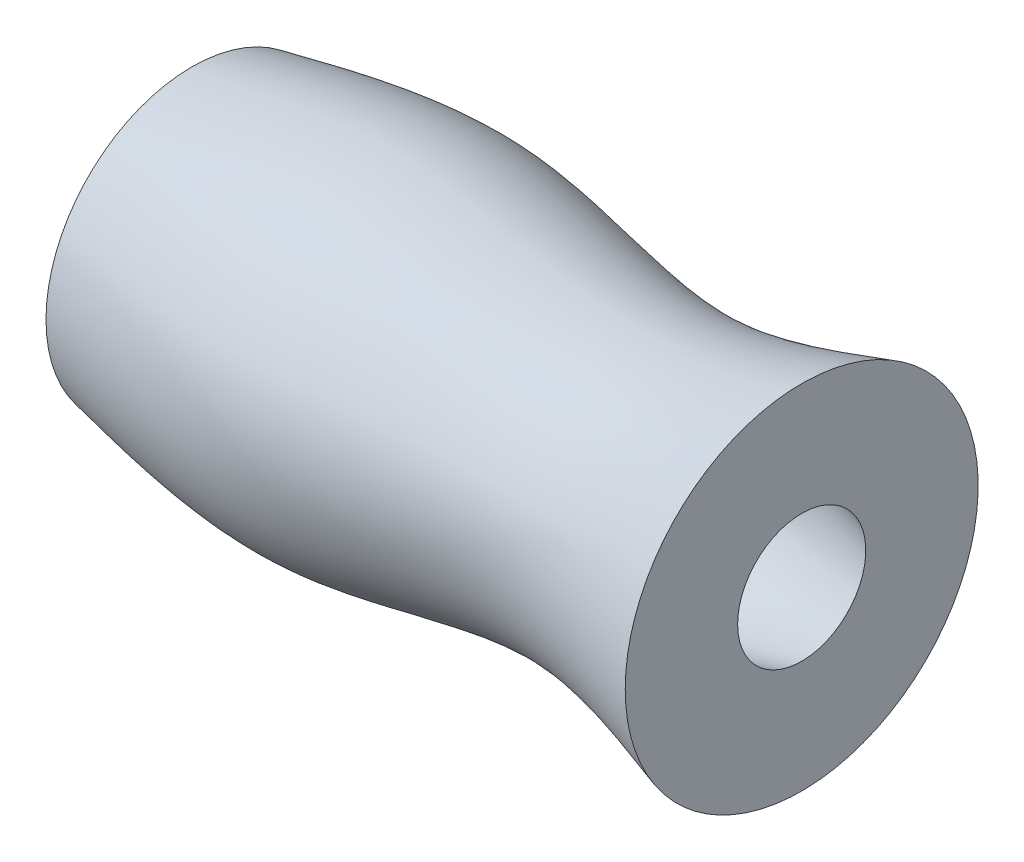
from build123d import *


with BuildPart() as part:
    # Skizze1 → Rotation1 (revolve)
    with BuildSketch(Plane.XY):
        with BuildLine():
            Line((0, 26.109650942), (0, 0))
            Line((0, 0), (109.052357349, 0))
            Line((109.052357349, 0), (109.052357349, 31.56226881))
            add(Edge.make_bspline(
                [(0, 26.109650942), (12.785741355, 28.737478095), (39.29539488, 34.18595272), (75.949196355, 21.082113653), (99.228115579, 28.452004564), (109.052357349, 31.56226881)],
                knots=[0, 0, 0, 0, 0.350001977, 0.725685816, 1, 1, 1, 1], degree=3))
        make_face()
    revolve(axis=Axis((0, 0, 0), (1, 0, 0)))

    # Skizze2 → Schnitt-Rotation1 (revolve, cut)
    with BuildSketch(Plane.XY):
        with BuildLine():
            Line((0, 0), (0, 19.317564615))
            add(Edge.make_bspline(
                [(0, 19.317564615), (4.932560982, 18.369536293), (16.054679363, 16.231887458), (35.359284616, 23.597334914), (56.936079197, 6.972668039), (83.318896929, 18.288430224), (100.926492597, 13.61592336), (109.052357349, 11.459572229)],
                knots=[0, 0, 0, 0, 0.134446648, 0.303155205, 0.51543259, 0.776373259, 1, 1, 1, 1], degree=3))
            Line((109.052357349, 11.459572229), (109.052357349, 0))
            Line((109.052357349, 0), (0, 0))
        make_face()
    revolve(axis=Axis((0, 0, 0), (1, 0, 0)), mode=Mode.SUBTRACT)


solid = part.part
